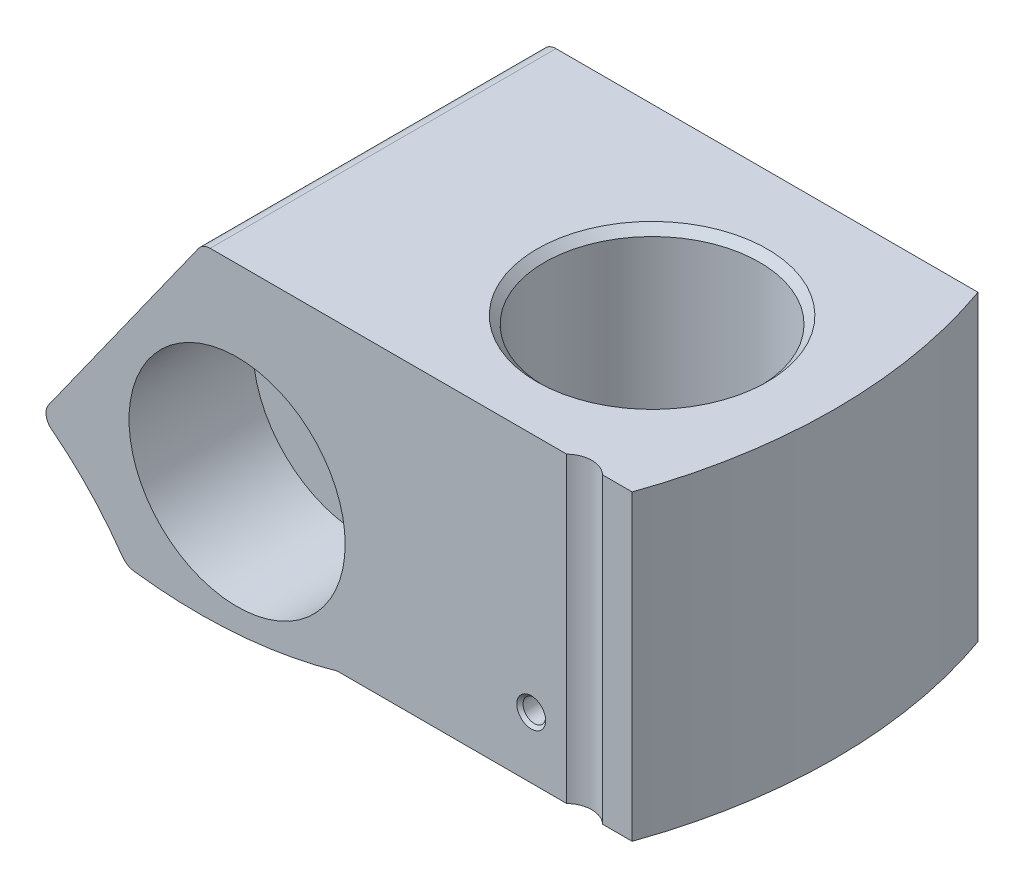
from build123d import *

# Parameters (mm, degrees)
LINEAR_AUSTRAGEN1_DEPTH      = 25.5
LINEAR_AUSTRAGEN2_DEPTH      = 15
LINEAR_AUSTRAGEN2_DEPTH_BACK = 15
SKIZZE2_R                    = 1.8
SKIZZE3_W                    = 50
SKIZZE3_H                    = 25
LINEAR_AUSTRAGEN3_DEPTH      = 1.5
LINEAR_AUSTRAGEN4_DEPTH      = 15
LINEAR_AUSTRAGEN4_DEPTH_BACK = 15


with BuildPart() as part:
    # Skizze1 → Linear austragen1 (new body)
    with BuildSketch(Plane.XY):
        with BuildLine():
            Line((6.952269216, -7.896), (30.6164, -7.896))
            Line((30.6164, -7.896), (30.6164, 13.104))
            Line((30.6164, 13.104), (-1.868124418, 13.104))
            ThreePointArc((-1.868124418, 13.104), (-2.326308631, 12.992857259), (-2.682645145, 12.684134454))
            Line((-2.682645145, 12.684134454), (-13.076846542, -1.909538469))
            ThreePointArc((-13.076846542, -1.909538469), (-13.251679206, -2.635205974), (-12.875283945, -3.279788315))
            ThreePointArc((-12.875283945, -3.279788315), (-10.228913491, -5.676004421), (-7.976052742, -8.445435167))
            ThreePointArc((-7.976052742, -8.445435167), (-7.613740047, -8.786432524), (-7.144257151, -8.951161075))
            ThreePointArc((-7.144257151, -8.951161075), (-0.042169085, -9.142659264), (6.952269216, -7.896))
        make_face()
    extrude(amount=-LINEAR_AUSTRAGEN1_DEPTH)

    # Skizze2 → Linear austragen2 (cut, two sides: drawn at the far end of the back side and taken through both)
    with BuildSketch(Plane(origin=(0, 0, 0), x_dir=(1, 0, 0), z_dir=(0, 1, 0)).offset(-LINEAR_AUSTRAGEN2_DEPTH_BACK)):
        with Locations((24.1178, -1.3)):
            Circle(SKIZZE2_R)
    extrude(amount=LINEAR_AUSTRAGEN2_DEPTH + LINEAR_AUSTRAGEN2_DEPTH_BACK, mode=Mode.SUBTRACT)

    # Skizze3 → Linear austragen3 (cut)
    with BuildSketch(Plane.XY.offset(-24)):
        with Locations((10, 2.5)):
            Rectangle(SKIZZE3_W, SKIZZE3_H)
        with BuildLine():
            Line((6.952269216, -7.896), (9.406957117, -7.896))
            ThreePointArc((9.406957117, -7.896), (3.78443787, 2.143657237), (-4.507973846, 10.12133535))
            Line((-4.507973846, 10.12133535), (-9.497130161, 3.116457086))
            ThreePointArc((-9.497130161, 3.116457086), (-3.65232049, -2.324059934), (0.58883127, -9.089683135))
            ThreePointArc((0.58883127, -9.089683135), (3.798211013, -8.64029912), (6.952269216, -7.896))
        make_face(mode=Mode.SUBTRACT)
    extrude(amount=-LINEAR_AUSTRAGEN3_DEPTH, mode=Mode.SUBTRACT)

    # Skizze4 → Linear austragen4 (cut, two sides: drawn at the far end of the back side and taken through both)
    with BuildSketch(Plane(origin=(0, 0, 0), x_dir=(1, 0, 0), z_dir=(0, 1, 0)).offset(-LINEAR_AUSTRAGEN4_DEPTH_BACK)):
        with BuildLine():
            Line((27.417825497, 0), (45, 0))
            Line((45, 0), (45, 24))
            Line((45, 24), (27.417825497, 24))
            ThreePointArc((27.417825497, 24), (29.4767, 12), (27.417825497, 0))
        make_face()
    extrude(amount=LINEAR_AUSTRAGEN4_DEPTH + LINEAR_AUSTRAGEN4_DEPTH_BACK, mode=Mode.SUBTRACT)

    # Skizze5 → Schnitt-Rotation1 (revolve, cut)
    with BuildSketch(Plane(origin=(0, 0, 0), x_dir=(0, 0, -1), z_dir=(1, 0, 0)), mode=Mode.PRIVATE) as schnitt_rotation1_sk:
        Polygon((0, 0), (0, 7.5), (8.6, 7.5), (8.6, 4.5), (25.5, 4.5), (25.5, 0), align=None)
    revolve(schnitt_rotation1_sk.sketch.rotate(Axis((0, 0, -25.5), (0, 0, 1)), 270), axis=Axis((0, 0, -25.5), (0, 0, 1)), mode=Mode.SUBTRACT)

    # Skizze6 → Schnitt-Rotation2 (revolve, cut)
    with BuildSketch(Plane(origin=(0, -3.646, 0), x_dir=(-1, 0, 0), z_dir=(0, 1, 0)), mode=Mode.PRIVATE) as schnitt_rotation2_sk:
        Polygon((-20.4121, -5), (-21.1956, -5), (-21.1956, -0.2165), (-21.4121, 0), (-20.4121, 0), align=None)
    revolve(schnitt_rotation2_sk.sketch.rotate(Axis((20.4121, -3.646, 0), (0, 0, -1)), 180), axis=Axis((20.4121, -3.646, 0), (0, 0, -1)), mode=Mode.SUBTRACT)

    # Skizze7 → Schnitt-Rotation3 (revolve, cut)
    with BuildSketch(Plane.XY.offset(-11.3), mode=Mode.PRIVATE) as schnitt_rotation3_sk:
        Polygon((17.5, 13.114), (25.5, 13.114), (24.9585, 12.5725), (24.9585, -7.3545), (25.5, -7.896), (17.5, -7.896), align=None)
    revolve(schnitt_rotation3_sk.sketch.rotate(Axis((17.5, -7.896, -11.3), (0, 1, 0)), 270), axis=Axis((17.5, -7.896, -11.3), (0, 1, 0)), mode=Mode.SUBTRACT)


solid = part.part
